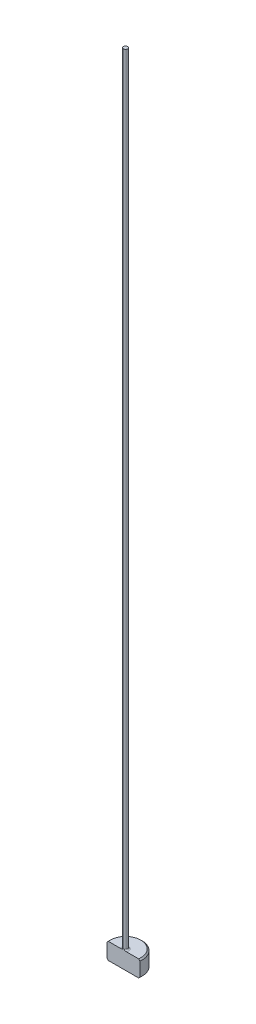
ISO-10303-21;
HEADER;
FILE_DESCRIPTION(('STEP AP214'),'2;1');
FILE_NAME('part.step','',(''),(''),'','','');
FILE_SCHEMA(('AUTOMOTIVE_DESIGN { 1 0 10303 214 1 1 1 1 }'));
ENDSEC;
DATA;
#1=APPLICATION_CONTEXT('core data for automotive mechanical design processes');
#2=APPLICATION_PROTOCOL_DEFINITION('international standard','automotive_design',2000,#1);
#3=PRODUCT_CONTEXT('',#1,'mechanical');
#4=PRODUCT('Part','Part','',(#3));
#5=PRODUCT_RELATED_PRODUCT_CATEGORY('part','',(#4));
#6=PRODUCT_DEFINITION_FORMATION('','',#4);
#7=PRODUCT_DEFINITION_CONTEXT('part definition',#1,'design');
#8=PRODUCT_DEFINITION('design','',#6,#7);
#9=PRODUCT_DEFINITION_SHAPE('','',#8);
#10=(LENGTH_UNIT() NAMED_UNIT(*) SI_UNIT(.MILLI.,.METRE.));
#11=(NAMED_UNIT(*) PLANE_ANGLE_UNIT() SI_UNIT($,.RADIAN.));
#12=(NAMED_UNIT(*) SI_UNIT($,.STERADIAN.) SOLID_ANGLE_UNIT());
#13=UNCERTAINTY_MEASURE_WITH_UNIT(LENGTH_MEASURE(1.E-05),#10,'distance_accuracy_value','');
#14=(GEOMETRIC_REPRESENTATION_CONTEXT(3) GLOBAL_UNCERTAINTY_ASSIGNED_CONTEXT((#13)) GLOBAL_UNIT_ASSIGNED_CONTEXT((#10,
#11,#12)) REPRESENTATION_CONTEXT('',''));
#15=CARTESIAN_POINT('',(0.,0.,0.));
#16=DIRECTION('',(0.,0.,1.));
#17=DIRECTION('',(1.,0.,0.));
#18=AXIS2_PLACEMENT_3D('',#15,#16,#17);
#19=CARTESIAN_POINT('',(0.,0.,0.));
#20=DIRECTION('',(0.,-1.,0.));
#21=DIRECTION('',(0.,0.,-1.));
#22=AXIS2_PLACEMENT_3D('',#19,#20,#21);
#23=PLANE('',#22);
#24=CARTESIAN_POINT('',(0.,0.,0.));
#25=DIRECTION('',(0.,-1.,0.));
#26=DIRECTION('',(0.,0.,-1.));
#27=AXIS2_PLACEMENT_3D('',#24,#25,#26);
#28=CIRCLE('',#27,2.92099999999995);
#29=CARTESIAN_POINT('',(-2.89399980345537,0.,0.396239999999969));
#30=VERTEX_POINT('',#29);
#31=CARTESIAN_POINT('',(2.89399980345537,0.,0.396239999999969));
#32=VERTEX_POINT('',#31);
#33=EDGE_CURVE('E98',#30,#32,#28,.T.);
#34=ORIENTED_EDGE('',*,*,#33,.T.);
#35=DIRECTION('',(-1.,0.,0.));
#36=VECTOR('',#35,1.);
#37=CARTESIAN_POINT('',(-3.15017759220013,0.,0.396239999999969));
#38=LINE('',#37,#36);
#39=EDGE_CURVE('E83',#32,#30,#38,.T.);
#40=ORIENTED_EDGE('',*,*,#39,.T.);
#41=EDGE_LOOP('',(#34,#40));
#42=FACE_BOUND('',#41,.T.);
#43=ADVANCED_FACE('F32',(#42),#23,.T.);
#44=CARTESIAN_POINT('',(0.,259.958771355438,0.));
#45=DIRECTION('',(0.,1.,0.));
#46=DIRECTION('',(0.,0.,1.));
#47=AXIS2_PLACEMENT_3D('',#44,#45,#46);
#48=CYLINDRICAL_SURFACE('',#47,3.17499999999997);
#49=CARTESIAN_POINT('',(0.,2.92099999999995,0.));
#50=DIRECTION('',(0.,1.,0.));
#51=DIRECTION('',(0.,0.,1.));
#52=AXIS2_PLACEMENT_3D('',#49,#50,#51);
#53=CIRCLE('',#52,3.17499999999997);
#54=CARTESIAN_POINT('',(-3.15017759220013,2.92099999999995,0.396239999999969));
#55=VERTEX_POINT('',#54);
#56=CARTESIAN_POINT('',(3.15017759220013,2.92099999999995,0.396239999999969));
#57=VERTEX_POINT('',#56);
#58=EDGE_CURVE('E104',#55,#57,#53,.F.);
#59=ORIENTED_EDGE('',*,*,#58,.T.);
#60=DIRECTION('',(0.,-1.,0.));
#61=VECTOR('',#60,1.);
#62=CARTESIAN_POINT('',(3.15017759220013,152.4,0.396239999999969));
#63=LINE('',#62,#61);
#64=CARTESIAN_POINT('',(3.15017759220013,0.254000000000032,0.396239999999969));
#65=VERTEX_POINT('',#64);
#66=EDGE_CURVE('E183',#57,#65,#63,.T.);
#67=ORIENTED_EDGE('',*,*,#66,.T.);
#68=CARTESIAN_POINT('',(0.,0.254000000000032,0.));
#69=DIRECTION('',(0.,-1.,0.));
#70=DIRECTION('',(0.,0.,-1.));
#71=AXIS2_PLACEMENT_3D('',#68,#69,#70);
#72=CIRCLE('',#71,3.17499999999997);
#73=CARTESIAN_POINT('',(-3.15017759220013,0.254000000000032,0.396239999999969));
#74=VERTEX_POINT('',#73);
#75=EDGE_CURVE('E100',#65,#74,#72,.F.);
#76=ORIENTED_EDGE('',*,*,#75,.T.);
#77=DIRECTION('',(0.,-1.,0.));
#78=VECTOR('',#77,1.);
#79=CARTESIAN_POINT('',(-3.15017759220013,152.4,0.396239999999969));
#80=LINE('',#79,#78);
#81=EDGE_CURVE('E93',#55,#74,#80,.T.);
#82=ORIENTED_EDGE('',*,*,#81,.F.);
#83=EDGE_LOOP('',(#59,#67,#76,#82));
#84=FACE_BOUND('',#83,.T.);
#85=ADVANCED_FACE('F158',(#84),#48,.T.);
#86=CARTESIAN_POINT('',(-3.17499999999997,3.175,0.));
#87=DIRECTION('',(0.,1.,0.));
#88=DIRECTION('',(0.,0.,1.));
#89=AXIS2_PLACEMENT_3D('',#86,#87,#88);
#90=PLANE('',#89);
#91=CARTESIAN_POINT('',(0.,3.175,0.));
#92=DIRECTION('',(0.,1.,0.));
#93=DIRECTION('',(0.,0.,1.));
#94=AXIS2_PLACEMENT_3D('',#91,#92,#93);
#95=CIRCLE('',#94,2.92099999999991);
#96=CARTESIAN_POINT('',(2.89399980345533,3.175,0.396239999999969));
#97=VERTEX_POINT('',#96);
#98=CARTESIAN_POINT('',(-2.89399980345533,3.175,0.396239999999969));
#99=VERTEX_POINT('',#98);
#100=EDGE_CURVE('E178',#97,#99,#95,.T.);
#101=ORIENTED_EDGE('',*,*,#100,.T.);
#102=DIRECTION('',(1.,0.,0.));
#103=VECTOR('',#102,1.);
#104=CARTESIAN_POINT('',(-3.17499999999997,3.175,0.396239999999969));
#105=LINE('',#104,#103);
#106=CARTESIAN_POINT('',(-0.515563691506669,3.17500000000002,0.396239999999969));
#107=VERTEX_POINT('',#106);
#108=EDGE_CURVE('E57',#99,#107,#105,.T.);
#109=ORIENTED_EDGE('',*,*,#108,.T.);
#110=CARTESIAN_POINT('',(0.,3.175,0.));
#111=DIRECTION('',(0.,1.,0.));
#112=DIRECTION('',(0.,0.,1.));
#113=AXIS2_PLACEMENT_3D('',#110,#111,#112);
#114=CIRCLE('',#113,0.650239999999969);
#115=CARTESIAN_POINT('',(0.515563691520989,3.17500000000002,0.396239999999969));
#116=VERTEX_POINT('',#115);
#117=EDGE_CURVE('E107',#107,#116,#114,.F.);
#118=ORIENTED_EDGE('',*,*,#117,.T.);
#119=EDGE_CURVE('E136',#116,#97,#105,.T.);
#120=ORIENTED_EDGE('',*,*,#119,.T.);
#121=EDGE_LOOP('',(#101,#109,#118,#120));
#122=FACE_BOUND('',#121,.T.);
#123=ADVANCED_FACE('F147',(#122),#90,.T.);
#124=CARTESIAN_POINT('',(0.,3.17499999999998,0.));
#125=DIRECTION('',(0.,-1.,0.));
#126=DIRECTION('',(0.,0.,-1.));
#127=AXIS2_PLACEMENT_3D('',#124,#125,#126);
#128=CONICAL_SURFACE('',#127,2.92099999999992,0.785398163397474);
#129=ORIENTED_EDGE('',*,*,#58,.F.);
#130=CARTESIAN_POINT('',(-6.93366147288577,-0.848974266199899,0.396239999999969));
#131=CARTESIAN_POINT('',(-6.69783963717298,-0.613539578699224,0.396239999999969));
#132=CARTESIAN_POINT('',(-6.46200107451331,-0.378121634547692,0.396239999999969));
#133=CARTESIAN_POINT('',(-5.99026657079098,0.0926621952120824,0.396239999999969));
#134=CARTESIAN_POINT('',(-5.75437062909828,0.328028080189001,0.396239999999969));
#135=CARTESIAN_POINT('',(-5.2824420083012,0.798744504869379,0.396239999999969));
#136=CARTESIAN_POINT('',(-5.04640930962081,1.03409502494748,0.396239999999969));
#137=CARTESIAN_POINT('',(-4.57423246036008,1.50467895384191,0.396239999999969));
#138=CARTESIAN_POINT('',(-4.33808831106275,1.73991236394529,0.396239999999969));
#139=CARTESIAN_POINT('',(-3.85746810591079,2.21830545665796,0.396239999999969));
#140=CARTESIAN_POINT('',(-3.61298561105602,2.46145867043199,0.396239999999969));
#141=CARTESIAN_POINT('',(-3.12367233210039,2.94743107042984,0.396239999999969));
#142=CARTESIAN_POINT('',(-2.87884153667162,3.19025024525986,0.396239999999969));
#143=CARTESIAN_POINT('',(-2.51107777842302,3.5539152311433,0.396239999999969));
#144=CARTESIAN_POINT('',(-2.38841380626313,3.67503289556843,0.396239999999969));
#145=CARTESIAN_POINT('',(-2.1427970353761,3.9169783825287,0.396239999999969));
#146=CARTESIAN_POINT('',(-2.01984423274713,4.0378062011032,0.396239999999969));
#147=CARTESIAN_POINT('',(-1.77347700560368,4.27897631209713,0.396239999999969));
#148=CARTESIAN_POINT('',(-1.65006261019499,4.39931863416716,0.396239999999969));
#149=CARTESIAN_POINT('',(-1.46427278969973,4.57913941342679,0.396239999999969));
#150=CARTESIAN_POINT('',(-1.40223216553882,4.63896356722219,0.396239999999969));
#151=CARTESIAN_POINT('',(-1.27782307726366,4.75826977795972,0.396239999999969));
#152=CARTESIAN_POINT('',(-1.21545461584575,4.81775183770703,0.396239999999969));
#153=CARTESIAN_POINT('',(-1.11914794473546,4.90882686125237,0.396239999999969));
#154=CARTESIAN_POINT('',(-1.08538772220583,4.94060795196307,0.396239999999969));
#155=CARTESIAN_POINT('',(-1.01767795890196,5.00396912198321,0.396239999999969));
#156=CARTESIAN_POINT('',(-0.983728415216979,5.03554919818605,0.396239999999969));
#157=CARTESIAN_POINT('',(-0.915697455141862,5.09833438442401,0.396239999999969));
#158=CARTESIAN_POINT('',(-0.881616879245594,5.12954040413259,0.396239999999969));
#159=CARTESIAN_POINT('',(-0.813124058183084,5.19158509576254,0.396239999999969));
#160=CARTESIAN_POINT('',(-0.778711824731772,5.22242378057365,0.396239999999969));
#161=CARTESIAN_POINT('',(-0.697678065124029,5.29395106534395,0.396239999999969));
#162=CARTESIAN_POINT('',(-0.650874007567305,5.33443305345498,0.396239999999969));
#163=CARTESIAN_POINT('',(-0.555628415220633,5.41407382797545,0.396239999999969));
#164=CARTESIAN_POINT('',(-0.50717853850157,5.45322287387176,0.396239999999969));
#165=CARTESIAN_POINT('',(-0.432351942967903,5.50976570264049,0.396239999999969));
#166=CARTESIAN_POINT('',(-0.406887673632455,5.52835735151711,0.396239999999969));
#167=CARTESIAN_POINT('',(-0.355035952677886,5.56430095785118,0.396239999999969));
#168=CARTESIAN_POINT('',(-0.328647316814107,5.581651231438,0.396239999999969));
#169=CARTESIAN_POINT('',(-0.274881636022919,5.61422039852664,0.396239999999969));
#170=CARTESIAN_POINT('',(-0.247515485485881,5.62945689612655,0.396239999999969));
#171=CARTESIAN_POINT('',(-0.191255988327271,5.65670374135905,0.396239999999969));
#172=CARTESIAN_POINT('',(-0.162367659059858,5.66872398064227,0.396239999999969));
#173=CARTESIAN_POINT('',(-0.105452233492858,5.68676866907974,0.396239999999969));
#174=CARTESIAN_POINT('',(-0.0775716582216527,5.69322637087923,0.396239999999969));
#175=CARTESIAN_POINT('',(-0.0211829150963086,5.70016429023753,0.396239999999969));
#176=CARTESIAN_POINT('',(0.00732047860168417,5.70068017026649,0.396239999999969));
#177=CARTESIAN_POINT('',(0.0636445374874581,5.69566875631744,0.396239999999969));
#178=CARTESIAN_POINT('',(0.0914673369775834,5.69016379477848,0.396239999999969));
#179=CARTESIAN_POINT('',(0.132245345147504,5.67848253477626,0.396239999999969));
#180=CARTESIAN_POINT('',(0.145732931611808,5.67399212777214,0.396239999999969));
#181=CARTESIAN_POINT('',(0.172358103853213,5.66407201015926,0.396239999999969));
#182=CARTESIAN_POINT('',(0.185495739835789,5.65864243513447,0.396239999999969));
#183=CARTESIAN_POINT('',(0.220905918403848,5.64278853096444,0.396239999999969));
#184=CARTESIAN_POINT('',(0.24283932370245,5.63161337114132,0.396239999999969));
#185=CARTESIAN_POINT('',(0.28586420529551,5.60773140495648,0.396239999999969));
#186=CARTESIAN_POINT('',(0.306954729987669,5.59502292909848,0.396239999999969));
#187=CARTESIAN_POINT('',(0.369366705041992,5.55526586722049,0.396239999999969));
#188=CARTESIAN_POINT('',(0.409684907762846,5.52665822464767,0.396239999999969));
#189=CARTESIAN_POINT('',(0.489078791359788,5.4670926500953,0.396239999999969));
#190=CARTESIAN_POINT('',(0.528139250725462,5.43611517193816,0.396239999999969));
#191=CARTESIAN_POINT('',(0.605156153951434,5.3729954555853,0.396239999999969));
#192=CARTESIAN_POINT('',(0.643114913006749,5.3408560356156,0.396239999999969));
#193=CARTESIAN_POINT('',(0.717575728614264,5.27650009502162,0.396239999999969));
#194=CARTESIAN_POINT('',(0.754091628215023,5.24429944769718,0.396239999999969));
#195=CARTESIAN_POINT('',(0.826682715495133,5.17940417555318,0.396239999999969));
#196=CARTESIAN_POINT('',(0.862757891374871,5.14670953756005,0.396239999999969));
#197=CARTESIAN_POINT('',(0.970527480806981,5.04810769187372,0.396239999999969));
#198=CARTESIAN_POINT('',(1.04175542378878,4.98169182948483,0.396239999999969));
#199=CARTESIAN_POINT('',(1.18360536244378,4.84805178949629,0.396239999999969));
#200=CARTESIAN_POINT('',(1.25422653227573,4.78082674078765,0.396239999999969));
#201=CARTESIAN_POINT('',(1.39502855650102,4.64592877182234,0.396239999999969));
#202=CARTESIAN_POINT('',(1.46520944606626,4.5782558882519,0.396239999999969));
#203=CARTESIAN_POINT('',(1.67392041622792,4.37617581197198,0.396239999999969));
#204=CARTESIAN_POINT('',(1.81204411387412,4.24134952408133,0.396239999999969));
#205=CARTESIAN_POINT('',(2.08768598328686,3.97121341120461,0.396239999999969));
#206=CARTESIAN_POINT('',(2.22520441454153,3.83590385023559,0.396239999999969));
#207=CARTESIAN_POINT('',(2.5520797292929,3.51353631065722,0.396239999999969));
#208=CARTESIAN_POINT('',(2.74129548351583,3.32633525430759,0.396239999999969));
#209=CARTESIAN_POINT('',(3.11941516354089,2.95161758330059,0.396239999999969));
#210=CARTESIAN_POINT('',(3.30831908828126,2.76410096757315,0.396239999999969));
#211=CARTESIAN_POINT('',(3.8748361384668,2.20119548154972,0.396239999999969));
#212=CARTESIAN_POINT('',(4.25217453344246,1.82553015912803,0.396239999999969));
#213=CARTESIAN_POINT('',(5.01368273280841,1.06678506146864,0.396239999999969));
#214=CARTESIAN_POINT('',(5.39784673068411,0.683699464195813,0.396239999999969));
#215=CARTESIAN_POINT('',(6.16590360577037,-0.0825728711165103,0.396239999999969));
#216=CARTESIAN_POINT('',(6.54979652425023,-0.465759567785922,0.396239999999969));
#217=CARTESIAN_POINT('',(6.93366147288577,-0.848974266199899,0.396239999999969));
#218=B_SPLINE_CURVE_WITH_KNOTS('',3,(#130,#131,#132,#133,#134,#135,#136,#137,#138,#139,#140,
#141,#142,#143,#144,#145,#146,#147,#148,#149,#150,#151,#152,#153,#154,#155,#156,#157,#158,#159,
#160,#161,#162,#163,#164,#165,#166,#167,#168,#169,#170,#171,#172,#173,#174,#175,#176,#177,#178,
#179,#180,#181,#182,#183,#184,#185,#186,#187,#188,#189,#190,#191,#192,#193,#194,#195,#196,#197,
#198,#199,#200,#201,#202,#203,#204,#205,#206,#207,#208,#209,#210,#211,#212,#213,#214,#215,#216,
#217),.UNSPECIFIED.,.F.,.F.,(4,2,2,2,2,2,2,2,2,2,2,2,2,2,2,2,2,2,2,2,2,2,2,2,2,2,2,2,2,2,2,2,2,
2,2,2,2,2,2,2,2,2,2,4),(0.,0.999686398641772,1.99938432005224,2.99934015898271,3.99928475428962,
5.03372005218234,6.06818979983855,6.58533878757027,7.10249480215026,7.61961873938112,
7.87817501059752,8.13672915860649,8.27582606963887,8.41492512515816,8.55355137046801,
8.69217273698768,8.87780830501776,9.06459283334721,9.15915597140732,9.25384503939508,
9.34769090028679,9.44124472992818,9.52659694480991,9.61143661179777,9.69596265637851,
9.73858308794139,9.78119737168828,9.85494794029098,9.92877954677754,10.0769229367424,
10.2264573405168,10.3756506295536,10.5217024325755,10.6677581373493,10.9599116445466,
11.2524142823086,11.5448932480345,12.1239460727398,12.7027201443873,13.5012312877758,
14.2997451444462,15.8971105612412,17.52469433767,19.15191656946),.UNSPECIFIED.);
#219=EDGE_CURVE('E135',#55,#99,#218,.T.);
#220=ORIENTED_EDGE('',*,*,#219,.T.);
#221=ORIENTED_EDGE('',*,*,#100,.F.);
#222=EDGE_CURVE('E127',#97,#57,#218,.T.);
#223=ORIENTED_EDGE('',*,*,#222,.T.);
#224=EDGE_LOOP('',(#129,#220,#221,#223));
#225=FACE_BOUND('',#224,.T.);
#226=ADVANCED_FACE('F143',(#225),#128,.T.);
#227=CARTESIAN_POINT('',(0.,0.254000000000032,0.));
#228=DIRECTION('',(0.,1.,0.));
#229=DIRECTION('',(0.,0.,1.));
#230=AXIS2_PLACEMENT_3D('',#227,#228,#229);
#231=CONICAL_SURFACE('',#230,3.17499999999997,0.785398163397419);
#232=ORIENTED_EDGE('',*,*,#75,.F.);
#233=CARTESIAN_POINT('',(6.93366147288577,4.0239742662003,0.396239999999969));
#234=CARTESIAN_POINT('',(6.69783963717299,3.7885395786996,0.396239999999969));
#235=CARTESIAN_POINT('',(6.46200107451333,3.55312163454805,0.396239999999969));
#236=CARTESIAN_POINT('',(5.99026657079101,3.08233780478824,0.396239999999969));
#237=CARTESIAN_POINT('',(5.75437062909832,2.8469719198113,0.396239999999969));
#238=CARTESIAN_POINT('',(5.28244200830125,2.37625549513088,0.396239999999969));
#239=CARTESIAN_POINT('',(5.04640930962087,2.14090497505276,0.396239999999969));
#240=CARTESIAN_POINT('',(4.57423246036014,1.67032104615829,0.396239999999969));
#241=CARTESIAN_POINT('',(4.33808831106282,1.4350876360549,0.396239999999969));
#242=CARTESIAN_POINT('',(3.85746810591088,0.95669454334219,0.396239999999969));
#243=CARTESIAN_POINT('',(3.61298561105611,0.713541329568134,0.396239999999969));
#244=CARTESIAN_POINT('',(3.1236723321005,0.227568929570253,0.396239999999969));
#245=CARTESIAN_POINT('',(2.87884153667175,-0.0152502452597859,0.396239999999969));
#246=CARTESIAN_POINT('',(2.51107777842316,-0.378915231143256,0.396239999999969));
#247=CARTESIAN_POINT('',(2.38841380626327,-0.500032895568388,0.396239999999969));
#248=CARTESIAN_POINT('',(2.14279703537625,-0.741978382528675,0.396239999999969));
#249=CARTESIAN_POINT('',(2.01984423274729,-0.862806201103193,0.396239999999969));
#250=CARTESIAN_POINT('',(1.77347700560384,-1.10397631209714,0.396239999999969));
#251=CARTESIAN_POINT('',(1.65006261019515,-1.22431863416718,0.396239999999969));
#252=CARTESIAN_POINT('',(1.46427278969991,-1.40413941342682,0.396239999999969));
#253=CARTESIAN_POINT('',(1.402232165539,-1.46396356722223,0.396239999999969));
#254=CARTESIAN_POINT('',(1.27782307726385,-1.58326977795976,0.396239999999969));
#255=CARTESIAN_POINT('',(1.21545461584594,-1.64275183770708,0.396239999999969));
#256=CARTESIAN_POINT('',(1.11914794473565,-1.73382686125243,0.396239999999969));
#257=CARTESIAN_POINT('',(1.08538772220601,-1.76560795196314,0.396239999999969));
#258=CARTESIAN_POINT('',(1.01767795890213,-1.8289691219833,0.396239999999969));
#259=CARTESIAN_POINT('',(0.983728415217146,-1.86054919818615,0.396239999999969));
#260=CARTESIAN_POINT('',(0.915697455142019,-1.92333438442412,0.396239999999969));
#261=CARTESIAN_POINT('',(0.881616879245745,-1.95454040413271,0.396239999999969));
#262=CARTESIAN_POINT('',(0.813124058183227,-2.01658509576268,0.396239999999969));
#263=CARTESIAN_POINT('',(0.77871182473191,-2.0474237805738,0.396239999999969));
#264=CARTESIAN_POINT('',(0.697678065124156,-2.11895106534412,0.396239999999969));
#265=CARTESIAN_POINT('',(0.650874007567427,-2.15943305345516,0.396239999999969));
#266=CARTESIAN_POINT('',(0.555628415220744,-2.23907382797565,0.396239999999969));
#267=CARTESIAN_POINT('',(0.507178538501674,-2.27822287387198,0.396239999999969));
#268=CARTESIAN_POINT('',(0.432351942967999,-2.33476570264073,0.396239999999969));
#269=CARTESIAN_POINT('',(0.406887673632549,-2.35335735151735,0.396239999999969));
#270=CARTESIAN_POINT('',(0.355035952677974,-2.38930095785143,0.396239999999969));
#271=CARTESIAN_POINT('',(0.328647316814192,-2.40665123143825,0.396239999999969));
#272=CARTESIAN_POINT('',(0.274881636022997,-2.43922039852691,0.396239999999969));
#273=CARTESIAN_POINT('',(0.247515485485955,-2.45445689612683,0.396239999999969));
#274=CARTESIAN_POINT('',(0.191255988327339,-2.48170374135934,0.396239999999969));
#275=CARTESIAN_POINT('',(0.162367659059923,-2.49372398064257,0.396239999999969));
#276=CARTESIAN_POINT('',(0.105452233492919,-2.51176866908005,0.396239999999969));
#277=CARTESIAN_POINT('',(0.0775716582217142,-2.51822637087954,0.396239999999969));
#278=CARTESIAN_POINT('',(0.0211829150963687,-2.52516429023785,0.396239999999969));
#279=CARTESIAN_POINT('',(-0.00732047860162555,-2.52568017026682,0.396239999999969));
#280=CARTESIAN_POINT('',(-0.0636445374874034,-2.52066875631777,0.396239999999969));
#281=CARTESIAN_POINT('',(-0.0914673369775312,-2.51516379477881,0.396239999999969));
#282=CARTESIAN_POINT('',(-0.132245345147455,-2.50348253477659,0.396239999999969));
#283=CARTESIAN_POINT('',(-0.145732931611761,-2.49899212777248,0.396239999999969));
#284=CARTESIAN_POINT('',(-0.172358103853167,-2.4890720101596,0.396239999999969));
#285=CARTESIAN_POINT('',(-0.185495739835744,-2.48364243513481,0.396239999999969));
#286=CARTESIAN_POINT('',(-0.220905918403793,-2.46778853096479,0.396239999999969));
#287=CARTESIAN_POINT('',(-0.242839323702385,-2.45661337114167,0.396239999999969));
#288=CARTESIAN_POINT('',(-0.285864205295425,-2.43273140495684,0.396239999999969));
#289=CARTESIAN_POINT('',(-0.306954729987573,-2.42002292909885,0.396239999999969));
#290=CARTESIAN_POINT('',(-0.369366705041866,-2.38026586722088,0.396239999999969));
#291=CARTESIAN_POINT('',(-0.4096849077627,-2.35165822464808,0.396239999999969));
#292=CARTESIAN_POINT('',(-0.489078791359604,-2.29209265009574,0.396239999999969));
#293=CARTESIAN_POINT('',(-0.528139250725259,-2.26111517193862,0.396239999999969));
#294=CARTESIAN_POINT('',(-0.605156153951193,-2.19799545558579,0.396239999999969));
#295=CARTESIAN_POINT('',(-0.643114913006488,-2.16585603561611,0.396239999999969));
#296=CARTESIAN_POINT('',(-0.717575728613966,-2.10150009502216,0.396239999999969));
#297=CARTESIAN_POINT('',(-0.754091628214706,-2.06929944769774,0.396239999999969));
#298=CARTESIAN_POINT('',(-0.826682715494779,-2.00440417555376,0.396239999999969));
#299=CARTESIAN_POINT('',(-0.862757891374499,-1.97170953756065,0.396239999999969));
#300=CARTESIAN_POINT('',(-0.970527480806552,-1.87310769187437,0.396239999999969));
#301=CARTESIAN_POINT('',(-1.04175542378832,-1.80669182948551,0.396239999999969));
#302=CARTESIAN_POINT('',(-1.18360536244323,-1.67305178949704,0.396239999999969));
#303=CARTESIAN_POINT('',(-1.25422653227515,-1.60582674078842,0.396239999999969));
#304=CARTESIAN_POINT('',(-1.39502855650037,-1.47092877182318,0.396239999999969));
#305=CARTESIAN_POINT('',(-1.46520944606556,-1.40325588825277,0.396239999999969));
#306=CARTESIAN_POINT('',(-1.67392041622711,-1.20117581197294,0.396239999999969));
#307=CARTESIAN_POINT('',(-1.81204411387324,-1.06634952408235,0.396239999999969));
#308=CARTESIAN_POINT('',(-2.08768598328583,-0.796213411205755,0.396239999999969));
#309=CARTESIAN_POINT('',(-2.22520441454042,-0.6609038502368,0.396239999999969));
#310=CARTESIAN_POINT('',(-2.55207972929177,-0.338536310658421,0.396239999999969));
#311=CARTESIAN_POINT('',(-2.74129548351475,-0.151335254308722,0.396239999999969));
#312=CARTESIAN_POINT('',(-3.1194151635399,0.223382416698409,0.396239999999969));
#313=CARTESIAN_POINT('',(-3.30831908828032,0.410899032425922,0.396239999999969));
#314=CARTESIAN_POINT('',(-3.87483613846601,0.97380451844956,0.396239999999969));
#315=CARTESIAN_POINT('',(-4.25217453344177,1.34946984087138,0.396239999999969));
#316=CARTESIAN_POINT('',(-5.01368273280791,2.10821493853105,0.396239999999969));
#317=CARTESIAN_POINT('',(-5.39784673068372,2.49130053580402,0.396239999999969));
#318=CARTESIAN_POINT('',(-6.16590360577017,3.25757287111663,0.396239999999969));
#319=CARTESIAN_POINT('',(-6.54979652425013,3.64075956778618,0.396239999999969));
#320=CARTESIAN_POINT('',(-6.93366147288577,4.0239742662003,0.396239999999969));
#321=B_SPLINE_CURVE_WITH_KNOTS('',3,(#233,#234,#235,#236,#237,#238,#239,#240,#241,#242,#243,
#244,#245,#246,#247,#248,#249,#250,#251,#252,#253,#254,#255,#256,#257,#258,#259,#260,#261,#262,
#263,#264,#265,#266,#267,#268,#269,#270,#271,#272,#273,#274,#275,#276,#277,#278,#279,#280,#281,
#282,#283,#284,#285,#286,#287,#288,#289,#290,#291,#292,#293,#294,#295,#296,#297,#298,#299,#300,
#301,#302,#303,#304,#305,#306,#307,#308,#309,#310,#311,#312,#313,#314,#315,#316,#317,#318,#319,
#320),.UNSPECIFIED.,.F.,.F.,(4,2,2,2,2,2,2,2,2,2,2,2,2,2,2,2,2,2,2,2,2,2,2,2,2,2,2,2,2,2,2,2,2,
2,2,2,2,2,2,2,2,2,2,4),(0.,0.999686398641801,1.9993843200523,2.99934015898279,3.99928475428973,
5.03372005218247,6.0681897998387,6.58533878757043,7.10249480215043,7.61961873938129,
7.8781750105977,8.13672915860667,8.27582606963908,8.4149251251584,8.55355137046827,
8.69217273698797,8.87780830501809,9.06459283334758,9.15915597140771,9.25384503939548,
9.34769090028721,9.44124472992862,9.52659694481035,9.61143661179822,9.69596265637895,
9.73858308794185,9.78119737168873,9.8549479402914,9.92877954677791,10.0769229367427,
10.226457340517,10.3756506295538,10.5217024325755,10.6677581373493,10.9599116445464,
11.2524142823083,11.544893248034,12.1239460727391,12.7027201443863,13.501231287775,
14.2997451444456,15.8971105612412,17.5246943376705,19.151916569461),.UNSPECIFIED.);
#322=EDGE_CURVE('E86',#65,#32,#321,.T.);
#323=ORIENTED_EDGE('',*,*,#322,.T.);
#324=ORIENTED_EDGE('',*,*,#33,.F.);
#325=EDGE_CURVE('E89',#30,#74,#321,.T.);
#326=ORIENTED_EDGE('',*,*,#325,.T.);
#327=EDGE_LOOP('',(#232,#323,#324,#326));
#328=FACE_BOUND('',#327,.T.);
#329=ADVANCED_FACE('F97',(#328),#231,.T.);
#330=CARTESIAN_POINT('',(0.,3.42900000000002,0.));
#331=DIRECTION('',(0.,1.,0.));
#332=DIRECTION('',(0.,0.,1.));
#333=AXIS2_PLACEMENT_3D('',#330,#331,#332);
#334=TOROIDAL_SURFACE('',#333,0.650239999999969,0.254);
#335=CARTESIAN_POINT('',(0.,3.42900000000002,0.396239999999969));
#336=CARTESIAN_POINT('',(2.93176772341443E-10,3.42900063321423,0.396239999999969));
#337=CARTESIAN_POINT('',(5.59531001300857E-08,3.42900126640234,0.396239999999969));
#338=CARTESIAN_POINT('',(2.55981685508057E-07,3.42900251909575,0.396239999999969));
#339=CARTESIAN_POINT('',(4.00595841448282E-07,3.42900313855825,0.396239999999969));
#340=CARTESIAN_POINT('',(9.44430444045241E-07,3.42900498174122,0.396239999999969));
#341=CARTESIAN_POINT('',(1.45261094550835E-06,3.42900617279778,0.396239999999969));
#342=CARTESIAN_POINT('',(2.68050052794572E-06,3.42900853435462,0.396239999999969));
#343=CARTESIAN_POINT('',(3.41192741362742E-06,3.42900969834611,0.396239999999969));
#344=CARTESIAN_POINT('',(5.00593807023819E-06,3.42901192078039,0.396239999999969));
#345=CARTESIAN_POINT('',(5.86781951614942E-06,3.42901297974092,0.396239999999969));
#346=CARTESIAN_POINT('',(8.90587653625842E-06,3.42901645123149,0.396239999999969));
#347=CARTESIAN_POINT('',(1.12536810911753E-05,3.4290187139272,0.396239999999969));
#348=CARTESIAN_POINT('',(1.61531122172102E-05,3.42902284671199,0.396239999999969));
#349=CARTESIAN_POINT('',(1.86977087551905E-05,3.42902472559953,0.396239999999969));
#350=CARTESIAN_POINT('',(2.83774515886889E-05,3.42903162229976,0.396239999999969));
#351=CARTESIAN_POINT('',(3.57138525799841E-05,3.42903634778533,0.396239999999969));
#352=CARTESIAN_POINT('',(5.00857273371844E-05,3.42904489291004,0.396239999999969));
#353=CARTESIAN_POINT('',(5.70953794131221E-05,3.42904875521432,0.396239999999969));
#354=CARTESIAN_POINT('',(0.000101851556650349,3.42907557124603,0.396239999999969));
#355=CARTESIAN_POINT('',(0.000134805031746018,3.42910566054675,0.396239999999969));
#356=CARTESIAN_POINT('',(0.000255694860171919,3.429210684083,0.396239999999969));
#357=CARTESIAN_POINT('',(0.000347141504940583,3.42928023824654,0.396239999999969));
#358=CARTESIAN_POINT('',(0.00067568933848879,3.42953512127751,0.396239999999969));
#359=CARTESIAN_POINT('',(0.000909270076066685,3.42972583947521,0.396239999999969));
#360=CARTESIAN_POINT('',(0.00179532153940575,3.43044426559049,0.396239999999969));
#361=CARTESIAN_POINT('',(0.00245163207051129,3.43096612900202,0.396239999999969));
#362=CARTESIAN_POINT('',(0.0146066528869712,3.44063677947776,0.396239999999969));
#363=CARTESIAN_POINT('',(0.0260655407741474,3.44984678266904,0.396239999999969));
#364=CARTESIAN_POINT('',(0.0487964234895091,3.46791975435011,0.396239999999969));
#365=CARTESIAN_POINT('',(0.060066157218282,3.47678570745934,0.396239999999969));
#366=CARTESIAN_POINT('',(0.0836206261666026,3.49505865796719,0.396239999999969));
#367=CARTESIAN_POINT('',(0.0959152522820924,3.50445311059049,0.396239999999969));
#368=CARTESIAN_POINT('',(0.120807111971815,3.52301212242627,0.396239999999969));
#369=CARTESIAN_POINT('',(0.133405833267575,3.53217468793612,0.396239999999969));
#370=CARTESIAN_POINT('',(0.166801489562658,3.55566155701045,0.396239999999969));
#371=CARTESIAN_POINT('',(0.187832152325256,3.56965885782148,0.396239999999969));
#372=CARTESIAN_POINT('',(0.230520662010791,3.5958516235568,0.396239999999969));
#373=CARTESIAN_POINT('',(0.252161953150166,3.60807349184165,0.396239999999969));
#374=CARTESIAN_POINT('',(0.286045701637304,3.6251365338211,0.396239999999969));
#375=CARTESIAN_POINT('',(0.297904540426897,3.630739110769,0.396239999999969));
#376=CARTESIAN_POINT('',(0.321963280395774,3.64127934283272,0.396239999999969));
#377=CARTESIAN_POINT('',(0.334164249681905,3.64621454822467,0.396239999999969));
#378=CARTESIAN_POINT('',(0.372237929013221,3.66021208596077,0.396239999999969));
#379=CARTESIAN_POINT('',(0.398620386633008,3.66796266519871,0.396239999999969));
#380=CARTESIAN_POINT('',(0.452312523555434,3.67902517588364,0.396239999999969));
#381=CARTESIAN_POINT('',(0.47962134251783,3.68234111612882,0.396239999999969));
#382=CARTESIAN_POINT('',(0.534051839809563,3.68347169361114,0.396239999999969));
#383=CARTESIAN_POINT('',(0.561170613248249,3.68136429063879,0.396239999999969));
#384=CARTESIAN_POINT('',(0.604511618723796,3.67285763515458,0.396239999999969));
#385=CARTESIAN_POINT('',(0.621101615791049,3.66830341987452,0.396239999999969));
#386=CARTESIAN_POINT('',(0.65337408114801,3.65654517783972,0.396239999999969));
#387=CARTESIAN_POINT('',(0.66905463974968,3.64933579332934,0.396239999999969));
#388=CARTESIAN_POINT('',(0.698994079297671,3.63218379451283,0.396239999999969));
#389=CARTESIAN_POINT('',(0.713243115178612,3.62222381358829,0.396239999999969));
#390=CARTESIAN_POINT('',(0.739544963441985,3.599736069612,0.396239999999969));
#391=CARTESIAN_POINT('',(0.75160038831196,3.5872113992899,0.396239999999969));
#392=CARTESIAN_POINT('',(0.771546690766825,3.56165038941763,0.396239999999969));
#393=CARTESIAN_POINT('',(0.779769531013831,3.54887294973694,0.396239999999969));
#394=CARTESIAN_POINT('',(0.793655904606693,3.52199450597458,0.396239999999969));
#395=CARTESIAN_POINT('',(0.79932118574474,3.50789441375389,0.396239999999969));
#396=CARTESIAN_POINT('',(0.807354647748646,3.48040106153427,0.396239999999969));
#397=CARTESIAN_POINT('',(0.810007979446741,3.46709056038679,0.396239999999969));
#398=CARTESIAN_POINT('',(0.812923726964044,3.44021163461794,0.396239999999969));
#399=CARTESIAN_POINT('',(0.813187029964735,3.42664330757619,0.396239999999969));
#400=CARTESIAN_POINT('',(0.811355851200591,3.40029497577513,0.396239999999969));
#401=CARTESIAN_POINT('',(0.809368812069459,3.38750732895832,0.396239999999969));
#402=CARTESIAN_POINT('',(0.803290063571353,3.36244456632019,0.396239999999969));
#403=CARTESIAN_POINT('',(0.799198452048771,3.35016942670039,0.396239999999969));
#404=CARTESIAN_POINT('',(0.789030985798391,3.32636730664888,0.396239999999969));
#405=CARTESIAN_POINT('',(0.782940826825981,3.31484645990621,0.396239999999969));
#406=CARTESIAN_POINT('',(0.76900734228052,3.29292164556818,0.396239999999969));
#407=CARTESIAN_POINT('',(0.761163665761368,3.28251790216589,0.396239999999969));
#408=CARTESIAN_POINT('',(0.743514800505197,3.26249857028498,0.396239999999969));
#409=CARTESIAN_POINT('',(0.733625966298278,3.25295690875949,0.396239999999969));
#410=CARTESIAN_POINT('',(0.712515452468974,3.23549416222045,0.396239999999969));
#411=CARTESIAN_POINT('',(0.701293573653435,3.22757331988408,0.396239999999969));
#412=CARTESIAN_POINT('',(0.676675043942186,3.21272310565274,0.396239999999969));
#413=CARTESIAN_POINT('',(0.663173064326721,3.20596883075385,0.396239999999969));
#414=CARTESIAN_POINT('',(0.635322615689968,3.19449747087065,0.396239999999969));
#415=CARTESIAN_POINT('',(0.620973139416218,3.18978286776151,0.396239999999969));
#416=CARTESIAN_POINT('',(0.589632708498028,3.18177951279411,0.396239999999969));
#417=CARTESIAN_POINT('',(0.572562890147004,3.1788010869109,0.396239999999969));
#418=CARTESIAN_POINT('',(0.538239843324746,3.1752512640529,0.396239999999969));
#419=CARTESIAN_POINT('',(0.520987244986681,3.17467329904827,0.396239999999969));
#420=CARTESIAN_POINT('',(0.477205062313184,3.1759381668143,0.396239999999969));
#421=CARTESIAN_POINT('',(0.450716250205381,3.17926308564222,0.396239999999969));
#422=CARTESIAN_POINT('',(0.398208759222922,3.19016478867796,0.396239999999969));
#423=CARTESIAN_POINT('',(0.372206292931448,3.19781458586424,0.396239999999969));
#424=CARTESIAN_POINT('',(0.325421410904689,3.21498716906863,0.396239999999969));
#425=CARTESIAN_POINT('',(0.304457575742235,3.22403143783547,0.396239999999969));
#426=CARTESIAN_POINT('',(0.263391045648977,3.24399776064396,0.396239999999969));
#427=CARTESIAN_POINT('',(0.243290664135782,3.25492450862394,0.396239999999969));
#428=CARTESIAN_POINT('',(0.205112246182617,3.27747757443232,0.396239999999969));
#429=CARTESIAN_POINT('',(0.186985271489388,3.28902237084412,0.396239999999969));
#430=CARTESIAN_POINT('',(0.151456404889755,3.31293720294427,0.396239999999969));
#431=CARTESIAN_POINT('',(0.134050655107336,3.32530156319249,0.396239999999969));
#432=CARTESIAN_POINT('',(0.108182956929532,3.34436153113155,0.396239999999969));
#433=CARTESIAN_POINT('',(0.0995556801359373,3.35083596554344,0.396239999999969));
#434=CARTESIAN_POINT('',(0.082239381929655,3.36402006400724,0.396239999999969));
#435=CARTESIAN_POINT('',(0.0735519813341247,3.37073186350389,0.396239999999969));
#436=CARTESIAN_POINT('',(0.0541902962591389,3.38583414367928,0.396239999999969));
#437=CARTESIAN_POINT('',(0.0435327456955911,3.39424571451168,0.396239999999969));
#438=CARTESIAN_POINT('',(0.022967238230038,3.41063042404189,0.396239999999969));
#439=CARTESIAN_POINT('',(0.0130546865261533,3.41859745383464,0.396239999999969));
#440=CARTESIAN_POINT('',(0.00245287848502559,3.42703291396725,0.396239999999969));
#441=CARTESIAN_POINT('',(0.00179779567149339,3.42755379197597,0.396239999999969));
#442=CARTESIAN_POINT('',(0.000912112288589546,3.42827189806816,0.396239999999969));
#443=CARTESIAN_POINT('',(0.000677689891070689,3.42846330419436,0.396239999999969));
#444=CARTESIAN_POINT('',(0.000347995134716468,3.42871906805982,0.396239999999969));
#445=CARTESIAN_POINT('',(0.000256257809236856,3.42878884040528,0.396239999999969));
#446=CARTESIAN_POINT('',(0.000135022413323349,3.42889417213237,0.396239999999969));
#447=CARTESIAN_POINT('',(0.000101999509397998,3.42892432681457,0.396239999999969));
#448=CARTESIAN_POINT('',(5.71490599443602E-05,3.42895118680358,0.396239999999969));
#449=CARTESIAN_POINT('',(5.01298552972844E-05,3.42895505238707,0.396239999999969));
#450=CARTESIAN_POINT('',(3.57387495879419E-05,3.4289636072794,0.396239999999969));
#451=CARTESIAN_POINT('',(2.83928271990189E-05,3.42896833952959,0.396239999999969));
#452=CARTESIAN_POINT('',(1.87022799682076E-05,3.42897524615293,0.396239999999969));
#453=CARTESIAN_POINT('',(1.61556534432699E-05,3.4289771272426,0.396239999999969));
#454=CARTESIAN_POINT('',(1.12526946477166E-05,3.42898126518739,0.396239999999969));
#455=CARTESIAN_POINT('',(8.90341601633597E-06,3.42898353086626,0.396239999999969));
#456=CARTESIAN_POINT('',(5.86406579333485E-06,3.42898700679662,0.396239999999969));
#457=CARTESIAN_POINT('',(5.00196631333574E-06,3.42898806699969,0.396239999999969));
#458=CARTESIAN_POINT('',(3.40777491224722E-06,3.42899029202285,0.396239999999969));
#459=CARTESIAN_POINT('',(2.67638739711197E-06,3.42899145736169,0.396239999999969));
#460=CARTESIAN_POINT('',(1.44895608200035E-06,3.4289938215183,0.396239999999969));
#461=CARTESIAN_POINT('',(9.41163734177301E-07,3.42899501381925,0.396239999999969));
#462=CARTESIAN_POINT('',(3.98264422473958E-07,3.42899685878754,0.396239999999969));
#463=CARTESIAN_POINT('',(2.54017523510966E-07,3.4289974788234,0.396239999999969));
#464=CARTESIAN_POINT('',(5.48617779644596E-08,3.42899873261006,0.396239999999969));
#465=CARTESIAN_POINT('',(-2.93393312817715E-10,3.42899936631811,0.396239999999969));
#466=CARTESIAN_POINT('',(0.,3.42900000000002,0.396239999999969));
#467=B_SPLINE_CURVE_WITH_KNOTS('',3,(#335,#336,#337,#338,#339,#340,#341,#342,#343,#344,#345,
#346,#347,#348,#349,#350,#351,#352,#353,#354,#355,#356,#357,#358,#359,#360,#361,#362,#363,#364,
#365,#366,#367,#368,#369,#370,#371,#372,#373,#374,#375,#376,#377,#378,#379,#380,#381,#382,#383,
#384,#385,#386,#387,#388,#389,#390,#391,#392,#393,#394,#395,#396,#397,#398,#399,#400,#401,#402,
#403,#404,#405,#406,#407,#408,#409,#410,#411,#412,#413,#414,#415,#416,#417,#418,#419,#420,#421,
#422,#423,#424,#425,#426,#427,#428,#429,#430,#431,#432,#433,#434,#435,#436,#437,#438,#439,#440,
#441,#442,#443,#444,#445,#446,#447,#448,#449,#450,#451,#452,#453,#454,#455,#456,#457,#458,#459,
#460,#461,#462,#463,#464,#465,#466),.UNSPECIFIED.,.T.,.F.,(4,2,2,2,2,2,2,2,2,2,2,2,2,2,2,2,2,2,
2,2,2,2,2,2,2,2,2,2,2,2,2,2,2,2,2,2,2,2,2,2,2,2,2,2,2,2,2,2,2,2,2,2,2,2,2,2,2,2,2,2,2,2,2,2,2,
4),(0.,1.89828878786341E-06,3.80184008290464E-06,7.65997321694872E-06,1.17719571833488E-05,
1.58625430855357E-05,2.5600940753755E-05,3.50818643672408E-05,6.12404597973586E-05,
8.52205426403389E-05,0.000217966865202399,0.000563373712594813,0.00146716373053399,
0.0039834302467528,0.0480782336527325,0.0910972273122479,0.137512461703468,0.184242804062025,
0.259985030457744,0.334450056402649,0.373777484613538,0.413245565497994,0.495415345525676,
0.577510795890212,0.658432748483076,0.709849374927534,0.761370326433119,0.813224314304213,
0.865016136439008,0.910344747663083,0.955642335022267,0.996153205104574,1.03664903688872,
1.07529001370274,1.11392919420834,1.15285118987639,1.19178098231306,1.23283388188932,
1.27389292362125,1.31900572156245,1.36417325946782,1.41596190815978,1.46760876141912,
1.54725207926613,1.62828190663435,1.69666793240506,1.76522701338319,1.82966536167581,
1.89369653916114,1.92605540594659,1.95898846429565,1.99972144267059,2.03786582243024,
2.04037737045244,2.04128441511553,2.04163091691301,2.04176394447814,2.04178795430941,
2.04181414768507,2.04182363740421,2.04183338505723,2.04183747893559,2.04184159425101,
2.04184545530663,2.04184736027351,2.04184925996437),.UNSPECIFIED.);
#468=CARTESIAN_POINT('',(0.,3.42900000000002,0.396239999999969));
#469=VERTEX_POINT('',#468);
#470=EDGE_CURVE('E11',#116,#469,#467,.T.);
#471=ORIENTED_EDGE('',*,*,#470,.F.);
#472=ORIENTED_EDGE('',*,*,#117,.F.);
#473=CARTESIAN_POINT('',(0.,3.42900000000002,0.396239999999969));
#474=CARTESIAN_POINT('',(-2.93176765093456E-10,3.4289993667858,0.396239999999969));
#475=CARTESIAN_POINT('',(-5.59531001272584E-08,3.42899873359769,0.396239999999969));
#476=CARTESIAN_POINT('',(-2.55981685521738E-07,3.42899748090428,0.396239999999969));
#477=CARTESIAN_POINT('',(-4.00595841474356E-07,3.42899686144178,0.396239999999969));
#478=CARTESIAN_POINT('',(-9.44430444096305E-07,3.42899501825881,0.396239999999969));
#479=CARTESIAN_POINT('',(-1.45261094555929E-06,3.42899382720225,0.396239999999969));
#480=CARTESIAN_POINT('',(-2.68050052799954E-06,3.42899146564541,0.396239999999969));
#481=CARTESIAN_POINT('',(-3.41192741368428E-06,3.42899030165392,0.396239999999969));
#482=CARTESIAN_POINT('',(-5.00593807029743E-06,3.42898807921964,0.396239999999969));
#483=CARTESIAN_POINT('',(-5.8678195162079E-06,3.42898702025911,0.396239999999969));
#484=CARTESIAN_POINT('',(-8.90587653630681E-06,3.42898354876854,0.396239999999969));
#485=CARTESIAN_POINT('',(-1.12536810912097E-05,3.42898128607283,0.396239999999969));
#486=CARTESIAN_POINT('',(-1.61531122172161E-05,3.42897715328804,0.396239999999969));
#487=CARTESIAN_POINT('',(-1.8697708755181E-05,3.4289752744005,0.396239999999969));
#488=CARTESIAN_POINT('',(-2.83774515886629E-05,3.42896837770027,0.396239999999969));
#489=CARTESIAN_POINT('',(-3.57138525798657E-05,3.4289636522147,0.396239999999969));
#490=CARTESIAN_POINT('',(-5.00857273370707E-05,3.42895510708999,0.396239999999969));
#491=CARTESIAN_POINT('',(-5.70953794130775E-05,3.42895124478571,0.396239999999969));
#492=CARTESIAN_POINT('',(-0.000101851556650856,3.428924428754,0.396239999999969));
#493=CARTESIAN_POINT('',(-0.000134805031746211,3.42889433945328,0.396239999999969));
#494=CARTESIAN_POINT('',(-0.000255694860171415,3.42878931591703,0.396239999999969));
#495=CARTESIAN_POINT('',(-0.00034714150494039,3.42871976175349,0.396239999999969));
#496=CARTESIAN_POINT('',(-0.000675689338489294,3.42846487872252,0.396239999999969));
#497=CARTESIAN_POINT('',(-0.000909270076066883,3.42827416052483,0.396239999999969));
#498=CARTESIAN_POINT('',(-0.0017953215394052,3.42755573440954,0.396239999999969));
#499=CARTESIAN_POINT('',(-0.00245163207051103,3.42703387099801,0.396239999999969));
#500=CARTESIAN_POINT('',(-0.014606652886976,3.41736322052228,0.396239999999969));
#501=CARTESIAN_POINT('',(-0.0260655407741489,3.40815321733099,0.396239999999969));
#502=CARTESIAN_POINT('',(-0.0487964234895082,3.39008024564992,0.396239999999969));
#503=CARTESIAN_POINT('',(-0.0600661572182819,3.38121429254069,0.396239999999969));
#504=CARTESIAN_POINT('',(-0.083620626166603,3.36294134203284,0.396239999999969));
#505=CARTESIAN_POINT('',(-0.0959152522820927,3.35354688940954,0.396239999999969));
#506=CARTESIAN_POINT('',(-0.120807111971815,3.33498787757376,0.396239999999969));
#507=CARTESIAN_POINT('',(-0.133405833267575,3.32582531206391,0.396239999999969));
#508=CARTESIAN_POINT('',(-0.166801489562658,3.30233844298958,0.396239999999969));
#509=CARTESIAN_POINT('',(-0.187832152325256,3.28834114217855,0.396239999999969));
#510=CARTESIAN_POINT('',(-0.230520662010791,3.26214837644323,0.396239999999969));
#511=CARTESIAN_POINT('',(-0.252161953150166,3.24992650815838,0.396239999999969));
#512=CARTESIAN_POINT('',(-0.286045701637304,3.23286346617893,0.396239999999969));
#513=CARTESIAN_POINT('',(-0.297904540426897,3.22726088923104,0.396239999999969));
#514=CARTESIAN_POINT('',(-0.321963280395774,3.21672065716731,0.396239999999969));
#515=CARTESIAN_POINT('',(-0.334164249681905,3.21178545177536,0.396239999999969));
#516=CARTESIAN_POINT('',(-0.372237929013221,3.19778791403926,0.396239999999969));
#517=CARTESIAN_POINT('',(-0.398620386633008,3.19003733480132,0.396239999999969));
#518=CARTESIAN_POINT('',(-0.452312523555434,3.17897482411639,0.396239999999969));
#519=CARTESIAN_POINT('',(-0.47962134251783,3.17565888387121,0.396239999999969));
#520=CARTESIAN_POINT('',(-0.534051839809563,3.17452830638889,0.396239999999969));
#521=CARTESIAN_POINT('',(-0.561170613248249,3.17663570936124,0.396239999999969));
#522=CARTESIAN_POINT('',(-0.604511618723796,3.18514236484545,0.396239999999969));
#523=CARTESIAN_POINT('',(-0.621101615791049,3.18969658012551,0.396239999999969));
#524=CARTESIAN_POINT('',(-0.65337408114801,3.20145482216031,0.396239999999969));
#525=CARTESIAN_POINT('',(-0.66905463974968,3.2086642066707,0.396239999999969));
#526=CARTESIAN_POINT('',(-0.698994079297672,3.2258162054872,0.396239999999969));
#527=CARTESIAN_POINT('',(-0.713243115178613,3.23577618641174,0.396239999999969));
#528=CARTESIAN_POINT('',(-0.739544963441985,3.25826393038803,0.396239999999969));
#529=CARTESIAN_POINT('',(-0.75160038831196,3.27078860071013,0.396239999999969));
#530=CARTESIAN_POINT('',(-0.771546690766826,3.2963496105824,0.396239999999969));
#531=CARTESIAN_POINT('',(-0.779769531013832,3.3091270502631,0.396239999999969));
#532=CARTESIAN_POINT('',(-0.793655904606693,3.33600549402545,0.396239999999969));
#533=CARTESIAN_POINT('',(-0.79932118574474,3.35010558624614,0.396239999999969));
#534=CARTESIAN_POINT('',(-0.807354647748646,3.37759893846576,0.396239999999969));
#535=CARTESIAN_POINT('',(-0.810007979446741,3.39090943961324,0.396239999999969));
#536=CARTESIAN_POINT('',(-0.812923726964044,3.41778836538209,0.396239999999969));
#537=CARTESIAN_POINT('',(-0.813187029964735,3.43135669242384,0.396239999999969));
#538=CARTESIAN_POINT('',(-0.811355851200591,3.4577050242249,0.396239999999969));
#539=CARTESIAN_POINT('',(-0.809368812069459,3.47049267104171,0.396239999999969));
#540=CARTESIAN_POINT('',(-0.803290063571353,3.49555543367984,0.396239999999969));
#541=CARTESIAN_POINT('',(-0.799198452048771,3.50783057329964,0.396239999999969));
#542=CARTESIAN_POINT('',(-0.789030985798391,3.53163269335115,0.396239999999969));
#543=CARTESIAN_POINT('',(-0.782940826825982,3.54315354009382,0.396239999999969));
#544=CARTESIAN_POINT('',(-0.76900734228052,3.56507835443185,0.396239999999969));
#545=CARTESIAN_POINT('',(-0.761163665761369,3.57548209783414,0.396239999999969));
#546=CARTESIAN_POINT('',(-0.743514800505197,3.59550142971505,0.396239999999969));
#547=CARTESIAN_POINT('',(-0.733625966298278,3.60504309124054,0.396239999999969));
#548=CARTESIAN_POINT('',(-0.712515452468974,3.62250583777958,0.396239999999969));
#549=CARTESIAN_POINT('',(-0.701293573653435,3.63042668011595,0.396239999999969));
#550=CARTESIAN_POINT('',(-0.676675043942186,3.64527689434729,0.396239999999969));
#551=CARTESIAN_POINT('',(-0.663173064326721,3.65203116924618,0.396239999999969));
#552=CARTESIAN_POINT('',(-0.635322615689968,3.66350252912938,0.396239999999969));
#553=CARTESIAN_POINT('',(-0.620973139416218,3.66821713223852,0.396239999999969));
#554=CARTESIAN_POINT('',(-0.589632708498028,3.67622048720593,0.396239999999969));
#555=CARTESIAN_POINT('',(-0.572562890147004,3.67919891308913,0.396239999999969));
#556=CARTESIAN_POINT('',(-0.538239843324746,3.68274873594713,0.396239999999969));
#557=CARTESIAN_POINT('',(-0.520987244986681,3.68332670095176,0.396239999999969));
#558=CARTESIAN_POINT('',(-0.477205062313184,3.68206183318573,0.396239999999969));
#559=CARTESIAN_POINT('',(-0.450716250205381,3.67873691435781,0.396239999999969));
#560=CARTESIAN_POINT('',(-0.398208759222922,3.66783521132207,0.396239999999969));
#561=CARTESIAN_POINT('',(-0.372206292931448,3.66018541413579,0.396239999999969));
#562=CARTESIAN_POINT('',(-0.325421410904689,3.6430128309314,0.396239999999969));
#563=CARTESIAN_POINT('',(-0.304457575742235,3.63396856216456,0.396239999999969));
#564=CARTESIAN_POINT('',(-0.263391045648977,3.61400223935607,0.396239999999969));
#565=CARTESIAN_POINT('',(-0.243290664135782,3.60307549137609,0.396239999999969));
#566=CARTESIAN_POINT('',(-0.205112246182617,3.58052242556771,0.396239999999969));
#567=CARTESIAN_POINT('',(-0.186985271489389,3.56897762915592,0.396239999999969));
#568=CARTESIAN_POINT('',(-0.151456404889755,3.54506279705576,0.396239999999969));
#569=CARTESIAN_POINT('',(-0.134050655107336,3.53269843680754,0.396239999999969));
#570=CARTESIAN_POINT('',(-0.108182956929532,3.51363846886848,0.396239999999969));
#571=CARTESIAN_POINT('',(-0.0995556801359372,3.50716403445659,0.396239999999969));
#572=CARTESIAN_POINT('',(-0.0822393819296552,3.49397993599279,0.396239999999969));
#573=CARTESIAN_POINT('',(-0.0735519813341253,3.48726813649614,0.396239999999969));
#574=CARTESIAN_POINT('',(-0.0541902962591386,3.47216585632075,0.396239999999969));
#575=CARTESIAN_POINT('',(-0.0435327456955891,3.46375428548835,0.396239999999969));
#576=CARTESIAN_POINT('',(-0.0229672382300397,3.44736957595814,0.396239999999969));
#577=CARTESIAN_POINT('',(-0.0130546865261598,3.43940254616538,0.396239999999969));
#578=CARTESIAN_POINT('',(-0.00245287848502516,3.43096708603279,0.396239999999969));
#579=CARTESIAN_POINT('',(-0.0017977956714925,3.43044620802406,0.396239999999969));
#580=CARTESIAN_POINT('',(-0.00091211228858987,3.42972810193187,0.396239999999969));
#581=CARTESIAN_POINT('',(-0.000677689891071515,3.42953669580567,0.396239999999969));
#582=CARTESIAN_POINT('',(-0.000347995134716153,3.42928093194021,0.396239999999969));
#583=CARTESIAN_POINT('',(-0.000256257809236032,3.42921115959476,0.396239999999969));
#584=CARTESIAN_POINT('',(-0.000135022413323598,3.42910582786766,0.396239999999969));
#585=CARTESIAN_POINT('',(-0.000101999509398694,3.42907567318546,0.396239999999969));
#586=CARTESIAN_POINT('',(-5.71490599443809E-05,3.42904881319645,0.396239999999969));
#587=CARTESIAN_POINT('',(-5.01298552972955E-05,3.42904494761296,0.396239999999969));
#588=CARTESIAN_POINT('',(-3.57387495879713E-05,3.42903639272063,0.396239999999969));
#589=CARTESIAN_POINT('',(-2.83928271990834E-05,3.42903166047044,0.396239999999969));
#590=CARTESIAN_POINT('',(-1.87022799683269E-05,3.4290247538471,0.396239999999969));
#591=CARTESIAN_POINT('',(-1.61556534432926E-05,3.42902287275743,0.396239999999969));
#592=CARTESIAN_POINT('',(-1.1252694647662E-05,3.42901873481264,0.396239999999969));
#593=CARTESIAN_POINT('',(-8.90341601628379E-06,3.42901646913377,0.396239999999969));
#594=CARTESIAN_POINT('',(-5.8640657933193E-06,3.42901299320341,0.396239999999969));
#595=CARTESIAN_POINT('',(-5.00196631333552E-06,3.42901193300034,0.396239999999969));
#596=CARTESIAN_POINT('',(-3.40777491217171E-06,3.42900970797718,0.396239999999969));
#597=CARTESIAN_POINT('',(-2.67638739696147E-06,3.42900854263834,0.396239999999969));
#598=CARTESIAN_POINT('',(-1.44895608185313E-06,3.42900617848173,0.396239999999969));
#599=CARTESIAN_POINT('',(-9.41163734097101E-07,3.42900498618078,0.396239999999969));
#600=CARTESIAN_POINT('',(-3.98264422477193E-07,3.42900314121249,0.396239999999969));
#601=CARTESIAN_POINT('',(-2.5401752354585E-07,3.42900252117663,0.396239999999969));
#602=CARTESIAN_POINT('',(-5.4861777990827E-08,3.42900126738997,0.396239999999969));
#603=CARTESIAN_POINT('',(2.9339330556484E-10,3.42900063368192,0.396239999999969));
#604=CARTESIAN_POINT('',(0.,3.42900000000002,0.396239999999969));
#605=B_SPLINE_CURVE_WITH_KNOTS('',3,(#473,#474,#475,#476,#477,#478,#479,#480,#481,#482,#483,
#484,#485,#486,#487,#488,#489,#490,#491,#492,#493,#494,#495,#496,#497,#498,#499,#500,#501,#502,
#503,#504,#505,#506,#507,#508,#509,#510,#511,#512,#513,#514,#515,#516,#517,#518,#519,#520,#521,
#522,#523,#524,#525,#526,#527,#528,#529,#530,#531,#532,#533,#534,#535,#536,#537,#538,#539,#540,
#541,#542,#543,#544,#545,#546,#547,#548,#549,#550,#551,#552,#553,#554,#555,#556,#557,#558,#559,
#560,#561,#562,#563,#564,#565,#566,#567,#568,#569,#570,#571,#572,#573,#574,#575,#576,#577,#578,
#579,#580,#581,#582,#583,#584,#585,#586,#587,#588,#589,#590,#591,#592,#593,#594,#595,#596,#597,
#598,#599,#600,#601,#602,#603,#604),.UNSPECIFIED.,.T.,.F.,(4,2,2,2,2,2,2,2,2,2,2,2,2,2,2,2,2,2,
2,2,2,2,2,2,2,2,2,2,2,2,2,2,2,2,2,2,2,2,2,2,2,2,2,2,2,2,2,2,2,2,2,2,2,2,2,2,2,2,2,2,2,2,2,2,2,
4),(0.,1.89828878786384E-06,3.8018400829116E-06,7.65997321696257E-06,1.17719571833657E-05,
1.58625430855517E-05,2.5600940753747E-05,3.50818643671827E-05,6.12404597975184E-05,
8.52205426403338E-05,0.000217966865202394,0.000563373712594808,0.00146716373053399,
0.00398343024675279,0.0480782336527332,0.0910972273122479,0.137512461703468,0.184242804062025,
0.259985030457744,0.334450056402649,0.373777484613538,0.413245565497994,0.495415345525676,
0.577510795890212,0.658432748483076,0.709849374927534,0.761370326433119,0.813224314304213,
0.865016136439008,0.910344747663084,0.955642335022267,0.996153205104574,1.03664903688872,
1.07529001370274,1.11392919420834,1.15285118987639,1.19178098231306,1.23283388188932,
1.27389292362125,1.31900572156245,1.36417325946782,1.41596190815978,1.46760876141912,
1.54725207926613,1.62828190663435,1.69666793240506,1.76522701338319,1.82966536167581,
1.89369653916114,1.92605540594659,1.95898846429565,1.99972144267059,2.03786582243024,
2.04037737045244,2.04128441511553,2.04163091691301,2.04176394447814,2.04178795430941,
2.04181414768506,2.04182363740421,2.04183338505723,2.04183747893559,2.04184159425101,
2.04184545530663,2.04184736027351,2.04184925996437),.UNSPECIFIED.);
#606=EDGE_CURVE('E46',#469,#107,#605,.T.);
#607=ORIENTED_EDGE('',*,*,#606,.F.);
#608=CARTESIAN_POINT('',(0.,3.42900000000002,0.));
#609=DIRECTION('',(0.,1.,0.));
#610=DIRECTION('',(0.,0.,1.));
#611=AXIS2_PLACEMENT_3D('',#608,#609,#610);
#612=CIRCLE('',#611,0.396239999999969);
#613=EDGE_CURVE('E103',#469,#469,#612,.T.);
#614=ORIENTED_EDGE('',*,*,#613,.F.);
#615=EDGE_LOOP('',(#471,#472,#607,#614));
#616=FACE_BOUND('',#615,.T.);
#617=ADVANCED_FACE('F34',(#616),#334,.F.);
#618=CARTESIAN_POINT('',(0.,259.958771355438,0.));
#619=DIRECTION('',(0.,1.,0.));
#620=DIRECTION('',(0.,0.,1.));
#621=AXIS2_PLACEMENT_3D('',#618,#619,#620);
#622=CYLINDRICAL_SURFACE('',#621,0.396239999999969);
#623=ORIENTED_EDGE('',*,*,#613,.T.);
#624=EDGE_LOOP('',(#623));
#625=FACE_BOUND('',#624,.T.);
#626=CARTESIAN_POINT('',(0.,152.4,0.));
#627=DIRECTION('',(0.,1.,0.));
#628=DIRECTION('',(0.,0.,1.));
#629=AXIS2_PLACEMENT_3D('',#626,#627,#628);
#630=CIRCLE('',#629,0.396239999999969);
#631=CARTESIAN_POINT('',(0.,152.4,0.396239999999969));
#632=VERTEX_POINT('',#631);
#633=EDGE_CURVE('E101',#632,#632,#630,.T.);
#634=ORIENTED_EDGE('',*,*,#633,.F.);
#635=EDGE_LOOP('',(#634));
#636=FACE_BOUND('',#635,.T.);
#637=ADVANCED_FACE('F155',(#625,#636),#622,.T.);
#638=CARTESIAN_POINT('',(-0.396239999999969,152.4,0.));
#639=DIRECTION('',(0.,1.,0.));
#640=DIRECTION('',(0.,0.,1.));
#641=AXIS2_PLACEMENT_3D('',#638,#639,#640);
#642=PLANE('',#641);
#643=ORIENTED_EDGE('',*,*,#633,.T.);
#644=EDGE_LOOP('',(#643));
#645=FACE_BOUND('',#644,.T.);
#646=ADVANCED_FACE('F121',(#645),#642,.T.);
#647=CARTESIAN_POINT('',(-3.15017759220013,152.4,0.396239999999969));
#648=DIRECTION('',(0.,0.,1.));
#649=DIRECTION('',(1.,0.,0.));
#650=AXIS2_PLACEMENT_3D('',#647,#648,#649);
#651=PLANE('',#650);
#652=ORIENTED_EDGE('',*,*,#66,.F.);
#653=ORIENTED_EDGE('',*,*,#222,.F.);
#654=ORIENTED_EDGE('',*,*,#119,.F.);
#655=ORIENTED_EDGE('',*,*,#470,.T.);
#656=ORIENTED_EDGE('',*,*,#606,.T.);
#657=ORIENTED_EDGE('',*,*,#108,.F.);
#658=ORIENTED_EDGE('',*,*,#219,.F.);
#659=ORIENTED_EDGE('',*,*,#81,.T.);
#660=ORIENTED_EDGE('',*,*,#325,.F.);
#661=ORIENTED_EDGE('',*,*,#39,.F.);
#662=ORIENTED_EDGE('',*,*,#322,.F.);
#663=EDGE_LOOP('',(#652,#653,#654,#655,#656,#657,#658,#659,#660,#661,#662));
#664=FACE_BOUND('',#663,.T.);
#665=ADVANCED_FACE('F85',(#664),#651,.T.);
#666=CLOSED_SHELL('',(#43,#85,#123,#226,#329,#617,#637,#646,#665));
#667=MANIFOLD_SOLID_BREP('B2',#666);
#668=ADVANCED_BREP_SHAPE_REPRESENTATION('',(#18,#667),#14);
#669=SHAPE_DEFINITION_REPRESENTATION(#9,#668);
ENDSEC;
END-ISO-10303-21;
